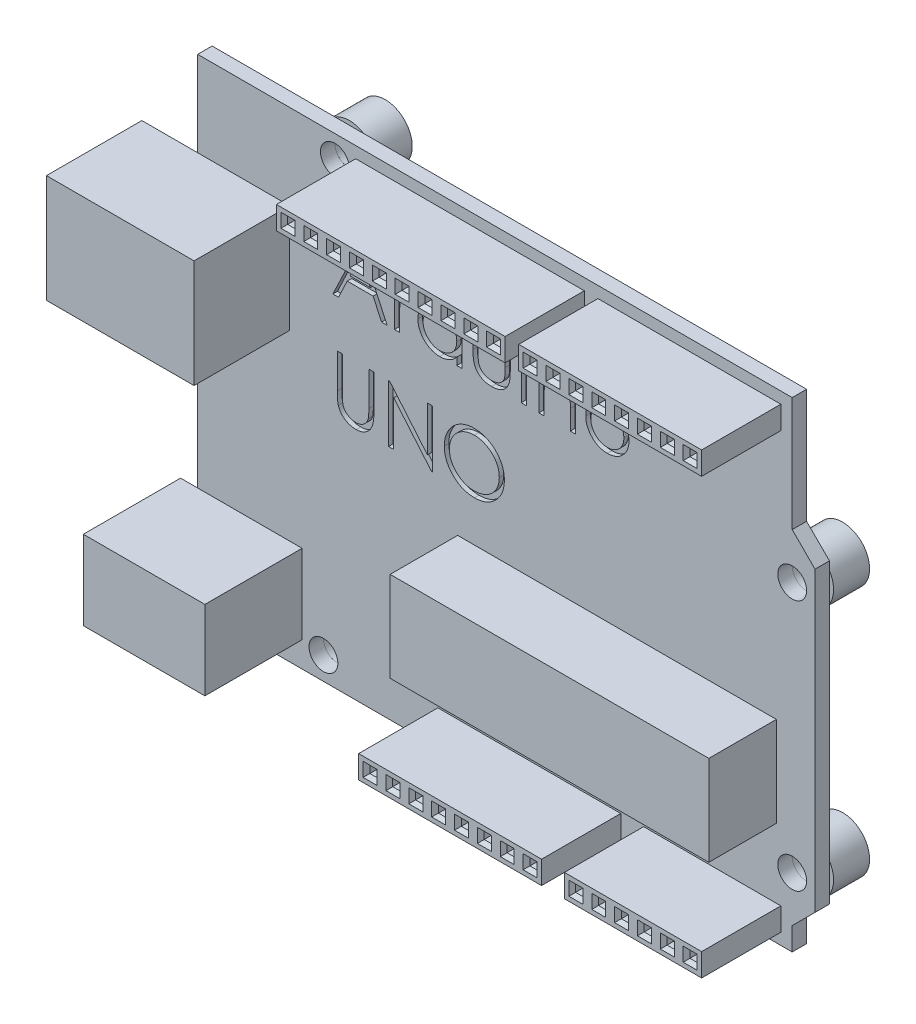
from build123d import *

# Parameters (mm, degrees)
ESQUISSE2_R             = 1.6
BOSS_EXTRU_1_DEPTH      = 1.6
ESQUISSE3_W             = 47.23
ESQUISSE3_H             = 2.54
ESQUISSE3_W_2           = 0.8
ESQUISSE3_H_2           = 0.8
ESQUISSE3_W_3           = 38.1
BOSS_EXTRU_2_DEPTH      = 8.8
CHANFREIN2_SIZE         = 0.375
ESQUISSE4_W             = 35.4
ESQUISSE4_H             = 10
BOSS_EXTRU_3_DEPTH      = 7.5
ESQUISSE5_W             = 16.4
ESQUISSE5_H             = 12
BOSS_EXTRU_4_DEPTH      = 10.6
ESQUISSE6_W             = 13.5
ESQUISSE6_H             = 8.8
BOSS_EXTRU_5_DEPTH      = 10.8
ESQUISSE7_W             = 2.54
ESQUISSE7_H             = 2.54
ESQUISSE7_W_2           = 1.51
ENL_V_MAT_EXTRU_1_DEPTH = 8.8
ESQUISSE8_R             = 3
ESQUISSE8_R_2           = 1.6
BOSS_EXTRU_6_DEPTH      = 4
BOSS_EXTRU_6_2_DEPTH    = 4
BOSS_EXTRU_6_3_DEPTH    = 4
BOSS_EXTRU_6_4_DEPTH    = 4
ESQUISSE9_W             = 0.569871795
ESQUISSE9_H             = 4.640384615
ENL_V_MAT_EXTRU_2_DEPTH = 0.5


with BuildPart() as part:
    # Esquisse2 → Boss.-Extru.1 (new body)
    with BuildSketch(Plane.XY):
        Polygon((0, 0), (66.04, 0), (66.04, 2.54), (68.58, 5.08), (68.58, 38.1), (66.04, 40.64), (66.04, 53.34), (0, 53.34), align=None)
        with Locations((15.24, 50.8)):
            Circle(ESQUISSE2_R, mode=Mode.SUBTRACT)
        with Locations((13.97, 2.54)):
            Circle(ESQUISSE2_R, mode=Mode.SUBTRACT)
        with Locations((66.04, 7.62)):
            Circle(ESQUISSE2_R, mode=Mode.SUBTRACT)
        with Locations((66.04, 35.56)):
            Circle(ESQUISSE2_R, mode=Mode.SUBTRACT)
    extrude(amount=BOSS_EXTRU_1_DEPTH)

    # Esquisse3 → Boss.-Extru.2 (add)
    # profile 1 of 2: a face of its own
    with BuildSketch(Plane.XY.offset(1.6)):
        with Locations((41.165, 50.8)):
            Rectangle(ESQUISSE3_W, ESQUISSE3_H)
        with Locations((63.51, 50.8)):
            Rectangle(ESQUISSE3_W_2, ESQUISSE3_H_2, mode=Mode.SUBTRACT)
        with Locations((60.97, 50.8)):
            Rectangle(ESQUISSE3_W_2, ESQUISSE3_H_2, mode=Mode.SUBTRACT)
        with Locations((58.43, 50.8)):
            Rectangle(ESQUISSE3_W_2, ESQUISSE3_H_2, mode=Mode.SUBTRACT)
        with Locations((55.89, 50.8)):
            Rectangle(ESQUISSE3_W_2, ESQUISSE3_H_2, mode=Mode.SUBTRACT)
        with Locations((53.35, 50.8)):
            Rectangle(ESQUISSE3_W_2, ESQUISSE3_H_2, mode=Mode.SUBTRACT)
        with Locations((50.81, 50.8)):
            Rectangle(ESQUISSE3_W_2, ESQUISSE3_H_2, mode=Mode.SUBTRACT)
        with Locations((48.27, 50.8)):
            Rectangle(ESQUISSE3_W_2, ESQUISSE3_H_2, mode=Mode.SUBTRACT)
        with Locations((45.73, 50.8)):
            Rectangle(ESQUISSE3_W_2, ESQUISSE3_H_2, mode=Mode.SUBTRACT)
        with Locations((41.68, 50.8)):
            Rectangle(ESQUISSE3_W_2, ESQUISSE3_H_2, mode=Mode.SUBTRACT)
        with Locations((39.14, 50.8)):
            Rectangle(ESQUISSE3_W_2, ESQUISSE3_H_2, mode=Mode.SUBTRACT)
        with Locations((36.6, 50.8)):
            Rectangle(ESQUISSE3_W_2, ESQUISSE3_H_2, mode=Mode.SUBTRACT)
        with Locations((34.06, 50.8)):
            Rectangle(ESQUISSE3_W_2, ESQUISSE3_H_2, mode=Mode.SUBTRACT)
        with Locations((31.52, 50.8)):
            Rectangle(ESQUISSE3_W_2, ESQUISSE3_H_2, mode=Mode.SUBTRACT)
        with Locations((28.98, 50.8)):
            Rectangle(ESQUISSE3_W_2, ESQUISSE3_H_2, mode=Mode.SUBTRACT)
        with Locations((26.44, 50.8)):
            Rectangle(ESQUISSE3_W_2, ESQUISSE3_H_2, mode=Mode.SUBTRACT)
        with Locations((23.9, 50.8)):
            Rectangle(ESQUISSE3_W_2, ESQUISSE3_H_2, mode=Mode.SUBTRACT)
        with Locations((21.36, 50.8)):
            Rectangle(ESQUISSE3_W_2, ESQUISSE3_H_2, mode=Mode.SUBTRACT)
        with Locations((18.82, 50.8)):
            Rectangle(ESQUISSE3_W_2, ESQUISSE3_H_2, mode=Mode.SUBTRACT)
    # profile 2 of 2: a face of its own
    with BuildSketch(Plane.XY.offset(1.6)):
        with Locations((45.73, 2.54)):
            Rectangle(ESQUISSE3_W_3, ESQUISSE3_H)
        with Locations((30.49, 2.54)):
            Rectangle(ESQUISSE3_W_2, ESQUISSE3_H_2, mode=Mode.SUBTRACT)
        with Locations((27.95, 2.54)):
            Rectangle(ESQUISSE3_W_2, ESQUISSE3_H_2, mode=Mode.SUBTRACT)
        with Locations((33.03, 2.54)):
            Rectangle(ESQUISSE3_W_2, ESQUISSE3_H_2, mode=Mode.SUBTRACT)
        with Locations((35.57, 2.54)):
            Rectangle(ESQUISSE3_W_2, ESQUISSE3_H_2, mode=Mode.SUBTRACT)
        with Locations((38.11, 2.54)):
            Rectangle(ESQUISSE3_W_2, ESQUISSE3_H_2, mode=Mode.SUBTRACT)
        with Locations((40.65, 2.54)):
            Rectangle(ESQUISSE3_W_2, ESQUISSE3_H_2, mode=Mode.SUBTRACT)
        with Locations((43.19, 2.54)):
            Rectangle(ESQUISSE3_W_2, ESQUISSE3_H_2, mode=Mode.SUBTRACT)
        with Locations((45.73, 2.54)):
            Rectangle(ESQUISSE3_W_2, ESQUISSE3_H_2, mode=Mode.SUBTRACT)
        with Locations((50.81, 2.54)):
            Rectangle(ESQUISSE3_W_2, ESQUISSE3_H_2, mode=Mode.SUBTRACT)
        with Locations((53.35, 2.54)):
            Rectangle(ESQUISSE3_W_2, ESQUISSE3_H_2, mode=Mode.SUBTRACT)
        with Locations((55.89, 2.54)):
            Rectangle(ESQUISSE3_W_2, ESQUISSE3_H_2, mode=Mode.SUBTRACT)
        with Locations((58.43, 2.54)):
            Rectangle(ESQUISSE3_W_2, ESQUISSE3_H_2, mode=Mode.SUBTRACT)
        with Locations((60.97, 2.54)):
            Rectangle(ESQUISSE3_W_2, ESQUISSE3_H_2, mode=Mode.SUBTRACT)
        with Locations((63.51, 2.54)):
            Rectangle(ESQUISSE3_W_2, ESQUISSE3_H_2, mode=Mode.SUBTRACT)
    extrude(amount=BOSS_EXTRU_2_DEPTH)

    # Chanfrein2
    chanfrein2_edges = [part.edges().sort_by_distance(p)[0] for p in [
        (63.91, 50.8, 10.4),
        (63.51, 51.2, 10.4),
        (63.11, 50.8, 10.4),
        (63.51, 50.4, 10.4),
        (39.54, 50.8, 10.4),
        (39.14, 51.2, 10.4),
        (38.74, 50.8, 10.4),
        (39.14, 50.4, 10.4),
        (61.37, 50.8, 10.4),
        (60.97, 51.2, 10.4),
        (60.57, 50.8, 10.4),
        (60.97, 50.4, 10.4),
        (58.83, 50.8, 10.4),
        (58.43, 51.2, 10.4),
        (58.03, 50.8, 10.4),
        (58.43, 50.4, 10.4),
        (56.29, 50.8, 10.4),
        (55.89, 51.2, 10.4),
        (55.49, 50.8, 10.4),
        (55.89, 50.4, 10.4),
        (53.75, 50.8, 10.4),
        (53.35, 51.2, 10.4),
        (52.95, 50.8, 10.4),
        (53.35, 50.4, 10.4),
        (51.21, 50.8, 10.4),
        (50.81, 51.2, 10.4),
        (50.41, 50.8, 10.4),
        (50.81, 50.4, 10.4),
        (48.67, 50.8, 10.4),
        (48.27, 51.2, 10.4),
        (47.87, 50.8, 10.4),
        (48.27, 50.4, 10.4),
        (46.13, 50.8, 10.4),
        (45.73, 51.2, 10.4),
        (45.33, 50.8, 10.4),
        (45.73, 50.4, 10.4),
        (42.08, 50.8, 10.4),
        (41.68, 51.2, 10.4),
        (41.28, 50.8, 10.4),
        (41.68, 50.4, 10.4),
        (37, 50.8, 10.4),
        (36.6, 51.2, 10.4),
        (36.2, 50.8, 10.4),
        (36.6, 50.4, 10.4),
        (34.46, 50.8, 10.4),
        (34.06, 51.2, 10.4),
        (33.66, 50.8, 10.4),
        (34.06, 50.4, 10.4),
        (31.92, 50.8, 10.4),
        (31.52, 51.2, 10.4),
        (31.12, 50.8, 10.4),
        (31.52, 50.4, 10.4),
        (29.38, 50.8, 10.4),
        (28.98, 51.2, 10.4),
        (28.58, 50.8, 10.4),
        (28.98, 50.4, 10.4),
        (26.84, 50.8, 10.4),
        (26.44, 51.2, 10.4),
        (26.04, 50.8, 10.4),
        (26.44, 50.4, 10.4),
        (24.3, 50.8, 10.4),
        (23.9, 51.2, 10.4),
        (23.5, 50.8, 10.4),
        (23.9, 50.4, 10.4),
        (21.76, 50.8, 10.4),
        (21.36, 51.2, 10.4),
        (20.96, 50.8, 10.4),
        (21.36, 50.4, 10.4),
        (19.22, 50.8, 10.4),
        (18.82, 51.2, 10.4),
        (18.42, 50.8, 10.4),
        (18.82, 50.4, 10.4),
        (28.35, 2.54, 10.4),
        (27.95, 2.94, 10.4),
        (27.55, 2.54, 10.4),
        (27.95, 2.14, 10.4),
        (30.89, 2.54, 10.4),
        (30.49, 2.94, 10.4),
        (30.09, 2.54, 10.4),
        (30.49, 2.14, 10.4),
        (33.43, 2.54, 10.4),
        (33.03, 2.94, 10.4),
        (32.63, 2.54, 10.4),
        (33.03, 2.14, 10.4),
        (35.97, 2.54, 10.4),
        (35.57, 2.94, 10.4),
        (35.17, 2.54, 10.4),
        (35.57, 2.14, 10.4),
        (38.51, 2.54, 10.4),
        (38.11, 2.94, 10.4),
        (37.71, 2.54, 10.4),
        (38.11, 2.14, 10.4),
        (41.05, 2.54, 10.4),
        (40.65, 2.94, 10.4),
        (40.25, 2.54, 10.4),
        (40.65, 2.14, 10.4),
        (43.59, 2.54, 10.4),
        (43.19, 2.94, 10.4),
        (42.79, 2.54, 10.4),
        (43.19, 2.14, 10.4),
        (46.13, 2.54, 10.4),
        (45.73, 2.94, 10.4),
        (45.33, 2.54, 10.4),
        (45.73, 2.14, 10.4),
        (51.21, 2.54, 10.4),
        (50.81, 2.94, 10.4),
        (50.41, 2.54, 10.4),
        (50.81, 2.14, 10.4),
        (53.75, 2.54, 10.4),
        (53.35, 2.94, 10.4),
        (52.95, 2.54, 10.4),
        (53.35, 2.14, 10.4),
        (56.29, 2.54, 10.4),
        (55.89, 2.94, 10.4),
        (55.49, 2.54, 10.4),
        (55.89, 2.14, 10.4),
        (58.83, 2.54, 10.4),
        (58.43, 2.94, 10.4),
        (58.03, 2.54, 10.4),
        (58.43, 2.14, 10.4),
        (61.37, 2.54, 10.4),
        (60.97, 2.94, 10.4),
        (60.57, 2.54, 10.4),
        (60.97, 2.14, 10.4),
        (63.91, 2.54, 10.4),
        (63.51, 2.94, 10.4),
        (63.11, 2.54, 10.4),
        (63.51, 2.14, 10.4),
    ]]
    chamfer(chanfrein2_edges, length=CHANFREIN2_SIZE)

    # Esquisse4 → Boss.-Extru.3 (add)
    with BuildSketch(Plane.XY.offset(1.6)):
        with Locations((46.58, 16.5)):
            Rectangle(ESQUISSE4_W, ESQUISSE4_H)
    extrude(amount=BOSS_EXTRU_3_DEPTH)

    # Esquisse5 → Boss.-Extru.4 (add)
    with BuildSketch(Plane.XY.offset(1.6)):
        with Locations((2, 37.87)):
            Rectangle(ESQUISSE5_W, ESQUISSE5_H)
    extrude(amount=BOSS_EXTRU_4_DEPTH)

    # Esquisse7 → Enl_v. mat.-Extru.1 (cut)
    with BuildSketch(Plane.XY.offset(10.4)):
        with Locations((48.27, 2.54)):
            Rectangle(ESQUISSE7_W, ESQUISSE7_H)
        with Locations((43.705, 50.8)):
            Rectangle(ESQUISSE7_W_2, ESQUISSE7_H)
    extrude(amount=-ENL_V_MAT_EXTRU_1_DEPTH, mode=Mode.SUBTRACT)

    # Esquisse9 → Enl_v. mat.-Extru.2 (cut)
    # profile 1 of 11: a face of its own
    with BuildSketch(Plane.XY.offset(1.6)):
        Polygon((18.114842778, 44.142918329), (21.045612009, 37.792918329), (20.426130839, 37.792918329), (19.48736882, 39.828174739), (16.608753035, 39.828174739), (15.643278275, 37.792918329), (15.021253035, 37.792918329), (18.033432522, 44.142918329), align=None)
        Polygon((18.067777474, 42.905228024), (16.917857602, 40.47945679), (19.1871685, 40.47945679), align=None, mode=Mode.SUBTRACT)
    # profile 2 of 11: a face of its own
    with BuildSketch(Plane.XY.offset(1.6)):
        with BuildLine():
            Line((21.859714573, 42.433302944), (22.429586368, 42.433302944))
            Line((22.429586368, 42.433302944), (22.429586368, 41.750220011))
            add(Edge.make_bspline(
                [(22.429586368, 41.750220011), (22.471657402, 41.8138213), (22.552117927, 41.93545827), (22.685854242, 42.096329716), (22.822838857, 42.229525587), (22.963727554, 42.335667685), (23.109556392, 42.4151572), (23.257124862, 42.473383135), (23.408754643, 42.507813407), (23.51064842, 42.512410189), (23.561697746, 42.514713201)],
                knots=[0, 0, 0, 0, 1.2804753, 2.448899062, 3.506932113, 4.484331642, 5.4025378, 6.288909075, 7.142734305, 8, 8, 8, 8], degree=3))
            add(Edge.make_bspline(
                [(23.561697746, 42.514713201), (23.601296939, 42.512553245), (23.68277485, 42.508108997), (23.806114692, 42.476883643), (23.933193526, 42.42703066), (24.015094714, 42.380149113), (24.057791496, 42.355708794)],
                knots=[0, 0, 0, 0, 0.901110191, 1.854092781, 2.881294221, 4, 4, 4, 4], degree=3))
            Line((24.057791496, 42.355708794), (23.744870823, 41.862159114))
            add(Edge.make_bspline(
                [(23.744870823, 41.862159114), (23.717458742, 41.874387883), (23.665425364, 41.897600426), (23.589307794, 41.925072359), (23.519128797, 41.941248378), (23.474418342, 41.943698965), (23.45357475, 41.944841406)],
                knots=[0, 0, 0, 0, 1.180555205, 2.24091978, 3.179933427, 4, 4, 4, 4], degree=3))
            add(Edge.make_bspline(
                [(23.45357475, 41.944841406), (23.407844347, 41.941793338), (23.314567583, 41.935576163), (23.177617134, 41.886701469), (23.044725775, 41.807734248), (22.939185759, 41.720156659), (22.857466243, 41.635705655), (22.799154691, 41.561957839), (22.745664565, 41.479265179), (22.694555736, 41.389041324), (22.647989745, 41.289745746), (22.604529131, 41.182370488), (22.565233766, 41.066791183), (22.542826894, 40.98626861), (22.531349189, 40.945021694)],
                knots=[0, 0, 0, 0, 1.125678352, 2.296057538, 3.5422874, 4.923748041, 5.663163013, 6.437101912, 7.23742474, 8.08941207, 8.991984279, 9.93940061, 10.944477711, 12, 12, 12, 12], degree=3))
            add(Edge.make_bspline(
                [(22.531349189, 40.945021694), (22.522763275, 40.908233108), (22.503746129, 40.826749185), (22.485255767, 40.690045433), (22.466986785, 40.52853108), (22.454111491, 40.341756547), (22.442177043, 40.130188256), (22.435445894, 39.893503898), (22.429815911, 39.631460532), (22.429665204, 39.448264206), (22.429586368, 39.352433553)],
                knots=[0, 0, 0, 0, 0.566838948, 1.255505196, 2.06880316, 3.007127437, 4.065329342, 5.249902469, 6.561414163, 8, 8, 8, 8], degree=3))
            Line((22.429586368, 39.352433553), (22.429586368, 37.792918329))
            Line((22.429586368, 37.792918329), (21.859714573, 37.792918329))
            Line((21.859714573, 37.792918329), (21.859714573, 42.433302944))
        make_face()
    # profile 3 of 11: a face of its own
    with BuildSketch(Plane.XY.offset(1.6)):
        with BuildLine():
            Line((29.349458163, 44.305738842), (29.349458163, 37.792918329))
            Line((29.349458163, 37.792918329), (28.779586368, 37.792918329))
            Line((28.779586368, 37.792918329), (28.779586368, 38.595572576))
            add(Edge.make_bspline(
                [(28.779586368, 38.595572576), (28.715326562, 38.522929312), (28.589922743, 38.38116507), (28.380479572, 38.195958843), (28.158468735, 38.04287246), (27.924967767, 37.919229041), (27.680187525, 37.826352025), (27.424670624, 37.760337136), (27.158312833, 37.717894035), (26.976426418, 37.713655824), (26.884253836, 37.711508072)],
                knots=[0, 0, 0, 0, 1.074387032, 2.096679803, 3.090159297, 4.057316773, 5.018401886, 5.985159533, 6.978961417, 8, 8, 8, 8], degree=3))
            add(Edge.make_bspline(
                [(26.884253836, 37.711508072), (26.802306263, 37.713733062), (26.64070202, 37.71812084), (26.402977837, 37.75216102), (26.17421047, 37.806826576), (25.954183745, 37.882846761), (25.744321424, 37.983686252), (25.542826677, 38.104411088), (25.350743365, 38.248176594), (25.170999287, 38.412529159), (25.005478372, 38.591045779), (24.860224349, 38.781446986), (24.73911519, 38.982909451), (24.637841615, 39.192882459), (24.559833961, 39.412982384), (24.505453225, 39.642448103), (24.4714527, 39.881008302), (24.467066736, 40.04345858), (24.464842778, 40.125830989)],
                knots=[0, 0, 0, 0, 1.033919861, 2.038935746, 3.024066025, 3.998881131, 4.97069526, 5.957263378, 6.95902576, 7.993208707, 9.027059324, 10.027763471, 11.009749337, 11.988697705, 12.965288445, 13.950418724, 14.960734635, 16, 16, 16, 16], degree=3))
            add(Edge.make_bspline(
                [(24.464842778, 40.125830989), (24.467116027, 40.206500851), (24.471610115, 40.365980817), (24.505089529, 40.600529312), (24.561388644, 40.826441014), (24.640396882, 41.04298861), (24.741710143, 41.25043413), (24.864951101, 41.44892429), (25.010128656, 41.639005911), (25.17750088, 41.816209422), (25.358811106, 41.979895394), (25.552774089, 42.122151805), (25.7545649, 42.245009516), (25.967313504, 42.342352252), (26.187870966, 42.42110877), (26.418200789, 42.475597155), (26.657344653, 42.507705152), (26.819705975, 42.512354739), (26.90206233, 42.514713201)],
                knots=[0, 0, 0, 0, 1.020392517, 2.01726096, 2.990465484, 3.961182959, 4.928053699, 5.906110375, 6.912531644, 7.948652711, 8.985773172, 9.998621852, 10.987621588, 11.969261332, 12.953316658, 13.946091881, 14.958173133, 16, 16, 16, 16], degree=3))
            add(Edge.make_bspline(
                [(26.90206233, 42.514713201), (26.996798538, 42.511870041), (27.182755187, 42.506289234), (27.454713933, 42.459650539), (27.711957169, 42.381340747), (27.955965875, 42.274132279), (28.185285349, 42.134793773), (28.401596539, 41.966516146), (28.601137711, 41.764536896), (28.719196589, 41.612841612), (28.779586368, 41.535246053)],
                knots=[0, 0, 0, 0, 1.031072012, 2.023879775, 2.993683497, 3.952812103, 4.918022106, 5.908088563, 6.929940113, 8, 8, 8, 8], degree=3))
            Line((28.779586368, 41.535246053), (28.779586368, 44.305738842))
            Line((28.779586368, 44.305738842), (29.349458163, 44.305738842))
        make_face()
        with BuildLine():
            add(Edge.make_bspline(
                [(26.909694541, 41.944841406), (26.826392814, 41.94187752), (26.661968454, 41.936027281), (26.420588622, 41.890355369), (26.189605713, 41.814364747), (25.970174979, 41.710439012), (25.765762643, 41.579758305), (25.583075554, 41.421695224), (25.42061951, 41.240562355), (25.283988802, 41.037177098), (25.172608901, 40.819139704), (25.094291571, 40.59122108), (25.042640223, 40.35753205), (25.037363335, 40.199031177), (25.034714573, 40.119470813)],
                knots=[0, 0, 0, 0, 1.031046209, 2.035121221, 3.029706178, 4.034933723, 5.034054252, 6.02443088, 7.017295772, 8.038157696, 9.050218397, 10.03989886, 11.016116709, 12, 12, 12, 12], degree=3))
            add(Edge.make_bspline(
                [(25.034714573, 40.119470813), (25.038098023, 40.040385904), (25.044851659, 39.882526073), (25.093385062, 39.648518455), (25.174809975, 39.420546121), (25.285920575, 39.200544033), (25.425052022, 38.996284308), (25.586321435, 38.811698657), (25.771288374, 38.652967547), (25.976171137, 38.520093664), (26.194988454, 38.412755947), (26.425101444, 38.338069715), (26.662184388, 38.289850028), (26.823387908, 38.28421762), (26.9046064, 38.281379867)],
                knots=[0, 0, 0, 0, 0.979072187, 1.954306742, 2.945804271, 3.96968567, 4.997920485, 5.998718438, 6.996577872, 8.005894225, 9.015743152, 10.005417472, 10.995077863, 12, 12, 12, 12], degree=3))
            add(Edge.make_bspline(
                [(26.9046064, 38.281379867), (26.987059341, 38.284391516), (27.151050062, 38.290381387), (27.393146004, 38.336248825), (27.628086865, 38.41202936), (27.852672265, 38.517074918), (28.061888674, 38.647263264), (28.249663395, 38.799676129), (28.408442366, 38.97693762), (28.543048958, 39.171749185), (28.648595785, 39.385312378), (28.725478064, 39.61270441), (28.770933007, 39.853933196), (28.776662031, 40.018786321), (28.779586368, 40.102934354)],
                knots=[0, 0, 0, 0, 1.01762866, 2.023962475, 3.030623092, 4.058876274, 5.077231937, 6.066672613, 7.034107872, 8.005628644, 8.981990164, 9.965428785, 10.961468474, 12, 12, 12, 12], degree=3))
            add(Edge.make_bspline(
                [(28.779586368, 40.102934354), (28.777845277, 40.167047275), (28.77441826, 40.293241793), (28.748237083, 40.478530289), (28.706590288, 40.655847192), (28.647905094, 40.825378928), (28.570813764, 40.98618817), (28.477835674, 41.139429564), (28.367335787, 41.284306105), (28.241092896, 41.418822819), (28.102907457, 41.541516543), (27.956685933, 41.651034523), (27.800695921, 41.741002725), (27.637560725, 41.815463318), (27.466997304, 41.874716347), (27.287617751, 41.914245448), (27.101328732, 41.941387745), (26.974245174, 41.943678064), (26.909694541, 41.944841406)],
                knots=[0, 0, 0, 0, 1.050140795, 2.067009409, 3.05949893, 4.030605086, 5.00011959, 5.97591094, 6.962425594, 7.979863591, 8.993523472, 9.986985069, 10.967611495, 11.937549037, 12.921786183, 13.919465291, 14.943216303, 16, 16, 16, 16], degree=3))
        make_face(mode=Mode.SUBTRACT)
    # profile 4 of 11: a face of its own
    with BuildSketch(Plane.XY.offset(1.6)):
        with BuildLine():
            Line((30.570612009, 42.433302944), (31.140483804, 42.433302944))
            Line((31.140483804, 42.433302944), (31.140483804, 40.28101929))
            add(Edge.make_bspline(
                [(31.140483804, 40.28101929), (31.14074126, 40.217840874), (31.141233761, 40.096983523), (31.144573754, 39.923074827), (31.152429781, 39.764475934), (31.162252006, 39.621095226), (31.17488331, 39.492956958), (31.189911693, 39.380508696), (31.206709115, 39.282475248), (31.223151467, 39.223432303), (31.230798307, 39.195973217)],
                knots=[0, 0, 0, 0, 1.388932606, 2.656963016, 3.823490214, 4.879454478, 5.816252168, 6.653371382, 7.373723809, 8, 8, 8, 8], degree=3))
            add(Edge.make_bspline(
                [(31.230798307, 39.195973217), (31.243065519, 39.161460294), (31.267344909, 39.093151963), (31.311383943, 38.994474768), (31.365863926, 38.903079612), (31.425481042, 38.815442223), (31.494241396, 38.734158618), (31.571275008, 38.659366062), (31.654003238, 38.588238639), (31.776930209, 38.504083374), (31.945040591, 38.413885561), (32.165753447, 38.33606029), (32.4050654, 38.289549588), (32.570464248, 38.28415344), (32.655477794, 38.281379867)],
                knots=[0, 0, 0, 0, 0.725840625, 1.436591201, 2.137033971, 2.831655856, 3.53531722, 4.242432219, 4.957935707, 5.694543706, 7.190802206, 8.724350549, 10.316345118, 12, 12, 12, 12], degree=3))
            add(Edge.make_bspline(
                [(32.655477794, 38.281379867), (32.740483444, 38.284212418), (32.904953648, 38.28969288), (33.141636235, 38.3346573), (33.357992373, 38.409779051), (33.551850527, 38.514658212), (33.722331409, 38.643004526), (33.864397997, 38.793606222), (33.981614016, 38.961698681), (34.032793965, 39.087109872), (34.058532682, 39.150179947)],
                knots=[0, 0, 0, 0, 1.157059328, 2.238695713, 3.266970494, 4.264342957, 5.228770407, 6.160125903, 7.074715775, 8, 8, 8, 8], degree=3))
            add(Edge.make_bspline(
                [(34.058532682, 39.150179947), (34.066142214, 39.175518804), (34.08296503, 39.231536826), (34.101039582, 39.326568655), (34.11732182, 39.439897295), (34.131225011, 39.572264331), (34.141140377, 39.72332385), (34.146485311, 39.893028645), (34.152523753, 40.08084597), (34.152615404, 40.212323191), (34.152663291, 40.28101929)],
                knots=[0, 0, 0, 0, 0.557542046, 1.232589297, 2.036731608, 2.971723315, 4.038036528, 5.22795436, 6.551621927, 8, 8, 8, 8], degree=3))
            Line((34.152663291, 40.28101929), (34.152663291, 42.433302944))
            Line((34.152663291, 42.433302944), (34.722535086, 42.433302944))
            Line((34.722535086, 42.433302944), (34.722535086, 40.174168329))
            add(Edge.make_bspline(
                [(34.722535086, 40.174168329), (34.721733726, 40.097411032), (34.720178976, 39.948491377), (34.710187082, 39.732075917), (34.693042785, 39.530395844), (34.667021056, 39.343344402), (34.636421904, 39.1710644), (34.596949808, 39.013335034), (34.549817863, 38.870642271), (34.496649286, 38.74048219), (34.433835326, 38.62246854), (34.367020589, 38.510462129), (34.289868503, 38.40724209), (34.208642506, 38.307670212), (34.118288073, 38.216699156), (34.020498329, 38.132241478), (33.916649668, 38.05300612), (33.804437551, 37.982083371), (33.685500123, 37.918190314), (33.559690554, 37.861555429), (33.425467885, 37.816737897), (33.284563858, 37.77807426), (33.13628813, 37.747749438), (32.980783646, 37.726365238), (32.818102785, 37.713256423), (32.707232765, 37.712100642), (32.650389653, 37.711508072)],
                knots=[0, 0, 0, 0, 1.493040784, 2.896703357, 4.213163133, 5.428574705, 6.569057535, 7.615249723, 8.588095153, 9.490268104, 10.346124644, 11.18633936, 12.024365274, 12.850166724, 13.684164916, 14.514361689, 15.362232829, 16.222528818, 17.093394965, 17.986930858, 18.902426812, 19.842810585, 20.827885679, 21.843828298, 22.894529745, 24, 24, 24, 24], degree=3))
            add(Edge.make_bspline(
                [(32.650389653, 37.711508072), (32.593971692, 37.712124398), (32.483105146, 37.713335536), (32.320415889, 37.726292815), (32.16448056, 37.747716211), (32.015853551, 37.778296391), (31.874385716, 37.816467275), (31.739504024, 37.861830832), (31.612787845, 37.918219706), (31.492714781, 37.981678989), (31.380224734, 38.053461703), (31.274799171, 38.132143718), (31.176579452, 38.217607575), (31.085543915, 38.309496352), (31.002970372, 38.408949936), (30.927829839, 38.51516831), (30.858965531, 38.627099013), (30.796639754, 38.746956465), (30.743096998, 38.878622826), (30.695825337, 39.024304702), (30.65716175, 39.185599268), (30.625697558, 39.362368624), (30.600385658, 39.553766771), (30.582812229, 39.760900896), (30.572986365, 39.983266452), (30.571420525, 40.136845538), (30.570612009, 40.216145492)],
                knots=[0, 0, 0, 0, 1.083640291, 2.129454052, 3.13281866, 4.105697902, 5.042300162, 5.946461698, 6.836384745, 7.703652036, 8.553297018, 9.397182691, 10.228592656, 11.052265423, 11.879314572, 12.708807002, 13.549817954, 14.402308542, 15.300838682, 16.27712199, 17.341985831, 18.484375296, 19.725102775, 21.0496083, 22.476576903, 24, 24, 24, 24], degree=3))
            Line((30.570612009, 40.216145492), (30.570612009, 42.433302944))
        make_face()
    # profile 5 of 11: a face of its own
    with BuildSketch(Plane.XY.offset(1.6)):
        with BuildLine():
            add(Edge.make_bspline(
                [(36.226080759, 44.387149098), (36.261443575, 44.385508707), (36.33069076, 44.382296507), (36.430827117, 44.354789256), (36.522007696, 44.308162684), (36.60288444, 44.245606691), (36.672284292, 44.172038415), (36.720872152, 44.086293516), (36.752100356, 43.993658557), (36.75587145, 43.929042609), (36.757791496, 43.896143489)],
                knots=[0, 0, 0, 0, 1.055194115, 2.066272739, 3.074728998, 4.095836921, 5.109056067, 6.073838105, 7.019297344, 8, 8, 8, 8], degree=3))
            add(Edge.make_bspline(
                [(36.757791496, 43.896143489), (36.755828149, 43.86409839), (36.751946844, 43.800749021), (36.720896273, 43.709720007), (36.671870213, 43.625166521), (36.602928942, 43.55174109), (36.521995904, 43.48921968), (36.43083025, 43.442583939), (36.330689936, 43.415079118), (36.261443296, 43.411866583), (36.226080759, 43.410226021)],
                knots=[0, 0, 0, 0, 0.96129708, 1.900370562, 2.859976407, 3.87933698, 4.906634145, 5.921202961, 6.938410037, 8, 8, 8, 8], degree=3))
            add(Edge.make_bspline(
                [(36.226080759, 43.410226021), (36.191122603, 43.411803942), (36.123081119, 43.414875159), (36.024444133, 43.44312362), (35.934041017, 43.489235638), (35.853006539, 43.551331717), (35.785460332, 43.625617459), (35.736296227, 43.709668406), (35.705317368, 43.800762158), (35.701426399, 43.864102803), (35.699458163, 43.896143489)],
                knots=[0, 0, 0, 0, 1.054934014, 2.053291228, 3.073705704, 4.106921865, 5.123545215, 6.088680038, 7.033164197, 8, 8, 8, 8], degree=3))
            add(Edge.make_bspline(
                [(35.699458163, 43.896143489), (35.701383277, 43.92903803), (35.705164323, 43.993644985), (35.736319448, 44.086345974), (35.785050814, 44.171583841), (35.853051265, 44.246015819), (35.934029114, 44.308146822), (36.024447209, 44.354249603), (36.123080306, 44.382500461), (36.191122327, 44.385571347), (36.226080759, 44.387149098)],
                knots=[0, 0, 0, 0, 0.98631895, 1.937192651, 2.907499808, 3.917963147, 4.944918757, 5.95915025, 6.951458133, 8, 8, 8, 8], degree=3))
        make_face()
    # profile 6 of 11: a face of its own
    with BuildSketch(Plane.XY.offset(1.6)):
        with Locations((36.22862483, 40.113110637)):
            Rectangle(ESQUISSE9_W, ESQUISSE9_H)
    # profile 7 of 11: a face of its own
    with BuildSketch(Plane.XY.offset(1.6)):
        with BuildLine():
            Line((37.897535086, 42.433302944), (38.467406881, 42.433302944))
            Line((38.467406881, 42.433302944), (38.467406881, 41.596303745))
            add(Edge.make_bspline(
                [(38.467406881, 41.596303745), (38.528253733, 41.6722184), (38.646329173, 41.819533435), (38.842969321, 42.013155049), (39.050784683, 42.172712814), (39.268502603, 42.299901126), (39.496418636, 42.395780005), (39.733143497, 42.465023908), (39.980094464, 42.506543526), (40.148032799, 42.511968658), (40.232991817, 42.514713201)],
                knots=[0, 0, 0, 0, 1.12780773, 2.188550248, 3.19190651, 4.159438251, 5.104880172, 6.052711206, 7.014878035, 8, 8, 8, 8], degree=3))
            add(Edge.make_bspline(
                [(40.232991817, 42.514713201), (40.31886311, 42.511546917), (40.486933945, 42.505349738), (40.731641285, 42.456333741), (40.960193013, 42.372613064), (41.171774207, 42.257928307), (41.362505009, 42.115313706), (41.530008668, 41.949165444), (41.668553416, 41.758055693), (41.761440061, 41.580757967), (41.822628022, 41.423479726), (41.861149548, 41.288774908), (41.8938629, 41.138700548), (41.922223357, 40.973710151), (41.94141326, 40.79264772), (41.956548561, 40.596255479), (41.96739562, 40.384597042), (41.967825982, 40.238208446), (41.968047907, 40.162720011)],
                knots=[0, 0, 0, 0, 1.235846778, 2.418850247, 3.575807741, 4.728682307, 5.871620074, 6.994088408, 8.11269785, 9.256955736, 9.865816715, 10.540099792, 11.271859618, 12.076849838, 12.949306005, 13.892391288, 14.913166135, 16, 16, 16, 16], degree=3))
            Line((41.968047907, 40.162720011), (41.968047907, 37.792918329))
            Line((41.968047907, 37.792918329), (41.398176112, 37.792918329))
            Line((41.398176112, 37.792918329), (41.398176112, 39.975730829))
            add(Edge.make_bspline(
                [(41.398176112, 39.975730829), (41.397825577, 40.038908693), (41.397155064, 40.159757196), (41.395040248, 40.332783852), (41.389942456, 40.489695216), (41.382779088, 40.630116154), (41.372294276, 40.753911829), (41.361367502, 40.861334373), (41.34800533, 40.9522474), (41.33609833, 41.006975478), (41.330758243, 41.031520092)],
                knots=[0, 0, 0, 0, 1.430800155, 2.736877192, 3.918605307, 4.986035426, 5.920637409, 6.731861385, 7.431261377, 8, 8, 8, 8], degree=3))
            add(Edge.make_bspline(
                [(41.330758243, 41.031520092), (41.311480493, 41.103567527), (41.274376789, 41.24223655), (41.182693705, 41.430331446), (41.066916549, 41.590348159), (40.925587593, 41.721297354), (40.760071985, 41.8232073), (40.570829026, 41.893917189), (40.35968492, 41.938142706), (40.211177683, 41.942546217), (40.133773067, 41.944841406)],
                knots=[0, 0, 0, 0, 1.084156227, 2.086665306, 3.027808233, 3.945421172, 4.874247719, 5.839848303, 6.874090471, 8, 8, 8, 8], degree=3))
            add(Edge.make_bspline(
                [(40.133773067, 41.944841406), (40.08793027, 41.943977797), (39.997208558, 41.942268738), (39.862679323, 41.925121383), (39.732188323, 41.897075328), (39.604425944, 41.859213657), (39.481947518, 41.807212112), (39.360818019, 41.74819454), (39.245598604, 41.674628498), (39.13383244, 41.592639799), (39.029850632, 41.501781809), (38.93309779, 41.405906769), (38.846850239, 41.303806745), (38.768711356, 41.197126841), (38.701259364, 41.084401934), (38.64238019, 40.96671955), (38.592422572, 40.843924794), (38.567598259, 40.758698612), (38.555177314, 40.716055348)],
                knots=[0, 0, 0, 0, 1.023777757, 2.026029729, 3.023749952, 4.003683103, 4.997618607, 5.993177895, 7.010360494, 8.046726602, 9.087585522, 10.09234134, 11.086953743, 12.070360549, 13.043493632, 14.017870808, 15.008233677, 16, 16, 16, 16], degree=3))
            add(Edge.make_bspline(
                [(38.555177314, 40.716055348), (38.548029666, 40.68474948), (38.53246961, 40.616598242), (38.515663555, 40.504757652), (38.500409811, 40.375380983), (38.487642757, 40.228619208), (38.479831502, 40.063958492), (38.471314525, 39.882102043), (38.4682138, 39.682324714), (38.467683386, 39.5432385), (38.467406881, 39.470732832)],
                knots=[0, 0, 0, 0, 0.615963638, 1.340920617, 2.168419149, 3.115676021, 4.16674242, 5.331190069, 6.6087489, 8, 8, 8, 8], degree=3))
            Line((38.467406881, 39.470732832), (38.467406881, 37.792918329))
            Line((38.467406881, 37.792918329), (37.897535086, 37.792918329))
            Line((37.897535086, 37.792918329), (37.897535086, 42.433302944))
        make_face()
    # profile 8 of 11: a face of its own
    with BuildSketch(Plane.XY.offset(1.6)):
        with BuildLine():
            add(Edge.make_bspline(
                [(45.511938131, 42.514713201), (45.599008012, 42.512859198), (45.769730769, 42.509223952), (46.019753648, 42.470371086), (46.258414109, 42.410958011), (46.4866262, 42.328822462), (46.701467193, 42.218728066), (46.90606645, 42.087356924), (47.099863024, 41.93172279), (47.216019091, 41.811330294), (47.274978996, 41.750220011)],
                knots=[0, 0, 0, 0, 1.054011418, 2.066658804, 3.057071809, 4.030435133, 4.997543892, 5.974964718, 6.972108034, 8, 8, 8, 8], degree=3))
            add(Edge.make_bspline(
                [(47.274978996, 41.750220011), (47.325746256, 41.691774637), (47.426298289, 41.576014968), (47.555231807, 41.388316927), (47.666305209, 41.193934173), (47.755319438, 40.990285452), (47.825505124, 40.779148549), (47.875335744, 40.559797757), (47.904975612, 40.332717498), (47.908972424, 40.178496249), (47.910996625, 40.100390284)],
                knots=[0, 0, 0, 0, 1.025258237, 2.030674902, 3.01204498, 3.988269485, 4.97094183, 5.956517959, 6.965070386, 8, 8, 8, 8], degree=3))
            add(Edge.make_bspline(
                [(47.910996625, 40.100390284), (47.909216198, 40.021831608), (47.905697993, 39.866596), (47.872417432, 39.637960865), (47.82065389, 39.416264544), (47.74657327, 39.2024352), (47.6515807, 38.995819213), (47.535664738, 38.79731903), (47.398011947, 38.606543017), (47.241976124, 38.425111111), (47.069524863, 38.257895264), (46.882442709, 38.112156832), (46.684406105, 37.987294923), (46.472781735, 37.886717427), (46.249502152, 37.807415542), (46.014085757, 37.75171694), (45.766898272, 37.718040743), (45.598120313, 37.71371626), (45.511938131, 37.711508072)],
                knots=[0, 0, 0, 0, 0.998656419, 1.973391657, 2.932242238, 3.890759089, 4.846373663, 5.82037756, 6.809684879, 7.83454468, 8.860553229, 9.859544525, 10.845671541, 11.83227036, 12.833544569, 13.85385346, 14.904124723, 16, 16, 16, 16], degree=3))
            add(Edge.make_bspline(
                [(45.511938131, 37.711508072), (45.425333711, 37.713723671), (45.25571458, 37.718063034), (45.007654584, 37.751586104), (44.771816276, 37.807389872), (44.54824439, 37.886978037), (44.335710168, 37.987298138), (44.136526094, 38.111779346), (43.949291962, 38.257938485), (43.776804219, 38.4250994), (43.620778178, 38.606546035), (43.483122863, 38.797318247), (43.367207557, 38.995819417), (43.272214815, 39.202435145), (43.19813424, 39.416264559), (43.146370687, 39.637960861), (43.113090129, 39.866596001), (43.109571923, 40.021831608), (43.107791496, 40.100390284)],
                knots=[0, 0, 0, 0, 1.099876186, 2.154163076, 3.173186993, 4.173200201, 5.163417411, 6.152872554, 7.150605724, 8.17532212, 9.198891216, 10.186952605, 11.159729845, 12.11414092, 13.071450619, 14.029093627, 15.002601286, 16, 16, 16, 16], degree=3))
            add(Edge.make_bspline(
                [(43.107791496, 40.100390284), (43.109829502, 40.178071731), (43.113864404, 40.331867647), (43.14347447, 40.558521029), (43.193110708, 40.777500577), (43.263380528, 40.987822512), (43.353215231, 41.190578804), (43.462727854, 41.385441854), (43.592976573, 41.572291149), (43.693128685, 41.687901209), (43.743809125, 41.746403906)],
                knots=[0, 0, 0, 0, 1.031353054, 2.041901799, 3.029428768, 4.008703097, 4.981709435, 5.96992636, 6.972712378, 8, 8, 8, 8], degree=3))
            add(Edge.make_bspline(
                [(43.743809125, 41.746403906), (43.80268014, 41.808044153), (43.91846035, 41.929270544), (44.113221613, 42.084450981), (44.317317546, 42.218555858), (44.534532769, 42.326462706), (44.762557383, 42.411441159), (45.002440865, 42.470524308), (45.253312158, 42.509083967), (45.424870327, 42.512818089), (45.511938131, 42.514713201)],
                knots=[0, 0, 0, 0, 1.027980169, 2.021703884, 2.998553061, 3.971491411, 4.943284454, 5.930300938, 6.949603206, 8, 8, 8, 8], degree=3))
        make_face()
        with BuildLine():
            add(Edge.make_bspline(
                [(45.509394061, 41.944841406), (45.447821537, 41.943091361), (45.326265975, 41.939636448), (45.147341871, 41.913358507), (44.975093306, 41.871725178), (44.809193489, 41.812572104), (44.650201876, 41.736192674), (44.497966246, 41.642378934), (44.35203882, 41.532373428), (44.215274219, 41.406348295), (44.089757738, 41.268682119), (43.980033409, 41.122000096), (43.886733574, 40.96868144), (43.809009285, 40.808566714), (43.75112053, 40.640033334), (43.709078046, 40.464989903), (43.682824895, 40.28307979), (43.679402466, 40.159416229), (43.677663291, 40.096574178)],
                knots=[0, 0, 0, 0, 1.021534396, 2.016698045, 2.994645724, 3.958388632, 4.93408049, 5.916473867, 6.921342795, 7.962252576, 8.998418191, 10.008913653, 10.997312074, 11.973003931, 12.956656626, 13.948281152, 14.957379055, 16, 16, 16, 16], degree=3))
            add(Edge.make_bspline(
                [(43.677663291, 40.096574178), (43.680578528, 40.015381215), (43.686364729, 39.854228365), (43.733418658, 39.616899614), (43.812133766, 39.389058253), (43.91842783, 39.172039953), (44.051607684, 38.97124882), (44.208519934, 38.792230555), (44.387480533, 38.637679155), (44.586356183, 38.509443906), (44.801084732, 38.407554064), (45.028335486, 38.335347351), (45.265355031, 38.288408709), (45.427335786, 38.28374332), (45.509394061, 38.281379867)],
                knots=[0, 0, 0, 0, 1.016792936, 2.018143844, 3.017858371, 4.030088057, 5.03801393, 6.028138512, 7.003788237, 7.991172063, 8.984598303, 9.972568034, 10.972917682, 12, 12, 12, 12], degree=3))
            add(Edge.make_bspline(
                [(45.509394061, 38.281379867), (45.591447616, 38.28375709), (45.753419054, 38.288449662), (45.990109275, 38.335110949), (46.21673891, 38.407870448), (46.431244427, 38.509329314), (46.63002955, 38.638166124), (46.810277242, 38.791357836), (46.965849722, 38.971722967), (47.098897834, 39.172305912), (47.206932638, 39.388721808), (47.285279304, 39.616941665), (47.332446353, 39.854217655), (47.338217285, 40.015377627), (47.34112483, 40.096574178)],
                knots=[0, 0, 0, 0, 1.02726834, 2.027799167, 3.010890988, 4.004497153, 4.992059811, 5.971914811, 6.958719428, 7.966827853, 8.981595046, 9.981490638, 10.983022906, 12, 12, 12, 12], degree=3))
            add(Edge.make_bspline(
                [(47.34112483, 40.096574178), (47.339386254, 40.159416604), (47.335965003, 40.283080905), (47.309703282, 40.464985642), (47.267692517, 40.640048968), (47.209686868, 40.808509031), (47.1323003, 40.969096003), (47.037201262, 41.121549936), (46.927924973, 41.269190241), (46.80089391, 41.405903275), (46.664272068, 41.532422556), (46.518285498, 41.642421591), (46.366275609, 41.735780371), (46.207745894, 41.813225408), (46.041824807, 41.871187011), (45.869817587, 41.9135989), (45.691656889, 41.939525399), (45.570536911, 41.94305807), (45.509394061, 41.944841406)],
                knots=[0, 0, 0, 0, 1.042956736, 2.052379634, 3.044323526, 4.02829302, 5.004299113, 5.996692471, 7.007513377, 8.048758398, 9.090003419, 10.095195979, 11.07790575, 12.047570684, 13.018257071, 13.989683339, 14.985167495, 16, 16, 16, 16], degree=3))
        make_face(mode=Mode.SUBTRACT)
    # profile 9 of 11: a face of its own
    with BuildSketch(Plane.XY.offset(1.6)):
        with BuildLine():
            Line((15.509714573, 32.559584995), (16.079586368, 32.559584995))
            Line((16.079586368, 32.559584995), (16.079586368, 28.754927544))
            add(Edge.make_bspline(
                [(16.079586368, 28.754927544), (16.079501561, 28.701078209), (16.079340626, 28.598889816), (16.080415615, 28.453441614), (16.083426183, 28.324133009), (16.085324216, 28.210465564), (16.089546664, 28.112960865), (16.092990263, 28.031090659), (16.09741813, 27.965242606), (16.102739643, 27.926814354), (16.105027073, 27.910296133)],
                knots=[0, 0, 0, 0, 1.528628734, 2.90083645, 4.128790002, 5.200304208, 6.127813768, 6.898992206, 7.526736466, 8, 8, 8, 8], degree=3))
            add(Edge.make_bspline(
                [(16.105027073, 27.910296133), (16.114420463, 27.85070272), (16.132677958, 27.734873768), (16.179207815, 27.569940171), (16.244190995, 27.421293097), (16.321194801, 27.28429404), (16.422672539, 27.162756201), (16.544236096, 27.050793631), (16.691515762, 26.952873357), (16.855274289, 26.863336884), (17.031777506, 26.791373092), (17.212137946, 26.736956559), (17.393644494, 26.703793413), (17.515158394, 26.699953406), (17.57549983, 26.698046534)],
                knots=[0, 0, 0, 0, 1.035780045, 2.013197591, 2.933192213, 3.817615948, 4.702609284, 5.640816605, 6.646850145, 7.73207398, 8.84249596, 9.914020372, 10.964143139, 12, 12, 12, 12], degree=3))
            add(Edge.make_bspline(
                [(17.57549983, 26.698046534), (17.627304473, 26.699994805), (17.73061455, 26.703880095), (17.884114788, 26.72794012), (18.033612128, 26.771302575), (18.17984479, 26.827254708), (18.316915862, 26.90118248), (18.444901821, 26.986582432), (18.559136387, 27.086750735), (18.663381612, 27.197604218), (18.754159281, 27.322680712), (18.832846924, 27.459256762), (18.897301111, 27.60938772), (18.929130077, 27.714896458), (18.945481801, 27.76910022)],
                knots=[0, 0, 0, 0, 0.994687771, 1.983630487, 2.973142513, 3.978332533, 4.983357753, 5.956394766, 6.925816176, 7.893390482, 8.871859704, 9.88551698, 10.913711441, 12, 12, 12, 12], degree=3))
            add(Edge.make_bspline(
                [(18.945481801, 27.76910022), (18.950924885, 27.791504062), (18.963054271, 27.841428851), (18.974388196, 27.925831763), (18.986192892, 28.025416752), (18.994383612, 28.140899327), (19.002368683, 28.27189252), (19.007145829, 28.41907873), (19.009353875, 28.581923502), (19.01001188, 28.69556521), (19.010355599, 28.754927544)],
                knots=[0, 0, 0, 0, 0.558680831, 1.244966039, 2.062412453, 2.990489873, 4.051219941, 5.244515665, 6.560634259, 8, 8, 8, 8], degree=3))
            Line((19.010355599, 28.754927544), (19.010355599, 32.559584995))
            Line((19.010355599, 32.559584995), (19.580227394, 32.559584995))
            Line((19.580227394, 32.559584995), (19.580227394, 28.724398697))
            add(Edge.make_bspline(
                [(19.580227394, 28.724398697), (19.579766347, 28.655277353), (19.578866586, 28.520382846), (19.571064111, 28.322713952), (19.558623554, 28.135202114), (19.541046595, 27.957822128), (19.517756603, 27.791208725), (19.491857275, 27.633901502), (19.458874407, 27.487029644), (19.420350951, 27.349447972), (19.3763118, 27.218482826), (19.319268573, 27.094188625), (19.254998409, 26.972786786), (19.178771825, 26.856113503), (19.093116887, 26.743652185), (18.996140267, 26.636084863), (18.891049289, 26.531692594), (18.776096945, 26.433153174), (18.653178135, 26.342786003), (18.522658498, 26.263324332), (18.385540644, 26.196152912), (18.242181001, 26.140860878), (18.09251839, 26.099287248), (17.936549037, 26.068308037), (17.773917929, 26.050705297), (17.663310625, 26.048089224), (17.607300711, 26.046764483)],
                knots=[0, 0, 0, 0, 1.316592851, 2.569410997, 3.76748051, 4.895814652, 5.963796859, 6.97159953, 7.931736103, 8.829262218, 9.692595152, 10.560224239, 11.431080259, 12.30701507, 13.211635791, 14.121146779, 15.063487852, 16.031507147, 17.00238618, 17.966455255, 18.938106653, 19.907068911, 20.888905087, 21.893141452, 22.933117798, 24, 24, 24, 24], degree=3))
            add(Edge.make_bspline(
                [(17.607300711, 26.046764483), (17.546215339, 26.048188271), (17.426366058, 26.050981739), (17.249766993, 26.066988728), (17.08046838, 26.097139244), (16.916682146, 26.135529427), (16.760638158, 26.188477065), (16.610245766, 26.250340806), (16.468080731, 26.326318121), (16.331836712, 26.410851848), (16.205154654, 26.50596512), (16.088863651, 26.609633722), (15.982771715, 26.720196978), (15.88866708, 26.838851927), (15.804990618, 26.964675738), (15.732908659, 27.098024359), (15.671017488, 27.238846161), (15.639074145, 27.336732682), (15.622925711, 27.386217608)],
                knots=[0, 0, 0, 0, 1.13879206, 2.234305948, 3.301075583, 4.341971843, 5.366689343, 6.369221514, 7.369726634, 8.367512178, 9.355451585, 10.318319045, 11.268648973, 12.207971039, 13.137398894, 14.081662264, 15.030215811, 16, 16, 16, 16], degree=3))
            add(Edge.make_bspline(
                [(15.622925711, 27.386217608), (15.613532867, 27.420022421), (15.593159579, 27.493345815), (15.571342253, 27.614697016), (15.553001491, 27.75442408), (15.535755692, 27.912536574), (15.52557944, 28.089157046), (15.516657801, 28.284208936), (15.509651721, 28.497928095), (15.509693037, 28.646798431), (15.509714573, 28.724398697)],
                knots=[0, 0, 0, 0, 0.625038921, 1.35572334, 2.194682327, 3.136881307, 4.189498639, 5.346923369, 6.617055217, 8, 8, 8, 8], degree=3))
            Line((15.509714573, 28.724398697), (15.509714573, 32.559584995))
        make_face()
    # profile 10 of 11: a face of its own
    with BuildSketch(Plane.XY.offset(1.6)):
        Polygon((21.208432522, 26.209584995), (21.208432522, 32.559584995), (21.328003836, 32.559584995), (25.523176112, 27.561758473), (25.523176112, 32.559584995), (26.093047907, 32.559584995), (26.093047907, 26.209584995), (25.963300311, 26.209584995), (21.778304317, 31.195963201), (21.778304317, 26.209584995), align=None)
    # profile 11 of 11: a face of its own
    with BuildSketch(Plane.XY.offset(1.6)):
        with BuildLine():
            add(Edge.make_bspline(
                [(30.692727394, 32.722405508), (30.810307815, 32.719427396), (31.041245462, 32.713578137), (31.380652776, 32.668803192), (31.704675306, 32.591341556), (32.015952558, 32.488175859), (32.310761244, 32.350554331), (32.591320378, 32.184211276), (32.85696242, 31.987403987), (33.104106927, 31.761653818), (33.330270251, 31.516029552), (33.529525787, 31.253905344), (33.696516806, 30.976866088), (33.83365102, 30.685744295), (33.94123564, 30.381198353), (34.015474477, 30.061604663), (34.062896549, 29.729033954), (34.068440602, 29.502199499), (34.071253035, 29.387129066)],
                knots=[0, 0, 0, 0, 1.065120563, 2.091984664, 3.0946048, 4.079830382, 5.057816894, 6.036188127, 7.030412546, 8.04752943, 9.064399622, 10.05169764, 11.02544977, 11.989514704, 12.962713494, 13.945757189, 14.957906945, 16, 16, 16, 16], degree=3))
            add(Edge.make_bspline(
                [(34.071253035, 29.387129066), (34.068441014, 29.27290627), (34.062898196, 29.047759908), (34.015420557, 28.717299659), (33.940960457, 28.39963511), (33.834650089, 28.095296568), (33.698169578, 27.803962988), (33.530066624, 27.526400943), (33.332053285, 27.262519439), (33.106706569, 27.015209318), (32.861050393, 26.788428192), (32.597561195, 26.590818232), (32.322164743, 26.420775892), (32.03131713, 26.285096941), (31.728875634, 26.176653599), (31.412133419, 26.102716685), (31.082574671, 26.055024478), (30.857837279, 26.049548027), (30.743608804, 26.046764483)],
                knots=[0, 0, 0, 0, 1.043624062, 2.057103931, 3.04512605, 4.022047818, 4.998200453, 5.980619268, 6.982898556, 8.009068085, 9.034988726, 10.034168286, 11.015286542, 11.987931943, 12.962482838, 13.94673481, 14.956375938, 16, 16, 16, 16], degree=3))
            add(Edge.make_bspline(
                [(30.743608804, 26.046764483), (30.628538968, 26.049575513), (30.401705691, 26.055116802), (30.068717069, 26.102617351), (29.748898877, 26.176896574), (29.443165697, 26.283049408), (29.151347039, 26.420240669), (28.872872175, 26.587525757), (28.608858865, 26.78602157), (28.361495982, 27.011295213), (28.135165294, 27.256535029), (27.937844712, 27.519305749), (27.770522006, 27.794452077), (27.633791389, 28.082737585), (27.525543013, 28.382768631), (27.451692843, 28.696546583), (27.403911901, 29.022282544), (27.398405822, 29.244066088), (27.395612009, 29.35660022)],
                knots=[0, 0, 0, 0, 1.053102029, 2.075944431, 3.073151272, 4.055350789, 5.033113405, 6.020478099, 7.024410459, 8.052272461, 9.079885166, 10.07527673, 11.055994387, 12.023226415, 12.992069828, 13.970394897, 14.97016774, 16, 16, 16, 16], degree=3))
            add(Edge.make_bspline(
                [(27.395612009, 29.35660022), (27.396581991, 29.432133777), (27.398509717, 29.582248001), (27.421717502, 29.805163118), (27.455393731, 30.024493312), (27.503657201, 30.239614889), (27.566779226, 30.450001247), (27.641259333, 30.657103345), (27.732227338, 30.858822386), (27.835062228, 31.056113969), (27.949837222, 31.245902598), (28.076611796, 31.425298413), (28.210933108, 31.595806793), (28.358186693, 31.753009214), (28.513519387, 31.901478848), (28.679451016, 32.038934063), (28.854969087, 32.166614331), (29.040828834, 32.28167695), (29.232450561, 32.385742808), (29.429984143, 32.475045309), (29.63074678, 32.551691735), (29.835678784, 32.613814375), (30.044235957, 32.662858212), (30.25687348, 32.696254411), (30.473421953, 32.719521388), (30.619311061, 32.721439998), (30.692727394, 32.722405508)],
                knots=[0, 0, 0, 0, 1.037015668, 2.060948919, 3.074880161, 4.083647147, 5.086022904, 6.090072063, 7.104153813, 8.122640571, 9.144368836, 10.147691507, 11.138137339, 12.123020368, 13.103399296, 14.087645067, 15.080126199, 16.082011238, 17.087798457, 18.072939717, 19.057185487, 20.037253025, 21.01195951, 21.997135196, 22.992090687, 24, 24, 24, 24], degree=3))
        make_face()
        with BuildLine():
            add(Edge.make_bspline(
                [(30.720712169, 32.071123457), (30.660451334, 32.07038887), (30.540505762, 32.06892672), (30.362189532, 32.049666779), (30.186218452, 32.022216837), (30.01255618, 31.983061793), (29.841929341, 31.92971444), (29.672747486, 31.868317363), (29.506553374, 31.793530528), (29.343895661, 31.709034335), (29.186206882, 31.615509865), (29.037412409, 31.512146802), (28.897127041, 31.401369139), (28.765694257, 31.282918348), (28.643499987, 31.156191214), (28.528139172, 31.023108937), (28.424235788, 30.879867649), (28.329011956, 30.730351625), (28.243798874, 30.574755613), (28.168024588, 30.41471772), (28.106041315, 30.248932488), (28.055491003, 30.079198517), (28.013581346, 29.905784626), (27.987031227, 29.7273753), (27.967559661, 29.544867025), (27.966181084, 29.421528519), (27.965483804, 29.35914429)],
                knots=[0, 0, 0, 0, 1.008559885, 2.007477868, 2.99961109, 3.989939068, 4.984837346, 5.991145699, 7.001802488, 8.033829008, 9.059044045, 10.069351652, 11.065060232, 12.050310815, 13.029377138, 14.011219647, 14.996725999, 15.989392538, 16.977580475, 17.965360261, 18.951710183, 19.937753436, 20.929683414, 21.935841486, 22.955955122, 24, 24, 24, 24], degree=3))
            add(Edge.make_bspline(
                [(27.965483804, 29.35914429), (27.967796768, 29.267409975), (27.972347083, 29.086940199), (28.012184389, 28.822475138), (28.073547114, 28.568314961), (28.164002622, 28.325850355), (28.277124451, 28.092997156), (28.416873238, 27.871821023), (28.582443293, 27.662262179), (28.770518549, 27.46578362), (28.976118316, 27.286449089), (29.194436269, 27.129035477), (29.423133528, 26.995848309), (29.662806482, 26.887344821), (29.912175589, 26.801366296), (30.172847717, 26.74244078), (30.443086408, 26.703659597), (30.627292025, 26.699935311), (30.720712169, 26.698046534)],
                knots=[0, 0, 0, 0, 1.032063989, 2.030389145, 3.003944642, 3.970395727, 4.937377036, 5.913328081, 6.909231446, 7.93887556, 8.970685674, 9.976071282, 10.964166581, 11.944589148, 12.933237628, 13.927779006, 14.949070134, 16, 16, 16, 16], degree=3))
            add(Edge.make_bspline(
                [(30.720712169, 26.698046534), (30.783503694, 26.698909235), (30.908038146, 26.700620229), (31.093268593, 26.717853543), (31.275162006, 26.745488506), (31.453463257, 26.785276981), (31.627969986, 26.835074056), (31.799410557, 26.894233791), (31.965958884, 26.968041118), (32.129716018, 27.049589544), (32.286463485, 27.14255383), (32.436097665, 27.242408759), (32.574846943, 27.353023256), (32.706181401, 27.469714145), (32.828877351, 27.594834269), (32.94210508, 27.728220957), (33.045483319, 27.870716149), (33.140670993, 28.020005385), (33.225585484, 28.176027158), (33.29957042, 28.336645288), (33.362337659, 28.501464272), (33.413007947, 28.670721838), (33.452714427, 28.84409652), (33.48007371, 29.021820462), (33.499211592, 29.203538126), (33.500654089, 29.326444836), (33.50138124, 29.388401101)],
                knots=[0, 0, 0, 0, 1.047197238, 2.076906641, 3.100256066, 4.114471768, 5.12198147, 6.126382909, 7.136867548, 8.15857795, 9.17633901, 10.174870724, 11.156907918, 12.133735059, 13.104061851, 14.077631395, 15.04955518, 16.038496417, 17.029181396, 18.010275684, 18.986308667, 19.968651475, 20.955262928, 21.950658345, 22.966943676, 24, 24, 24, 24], degree=3))
            add(Edge.make_bspline(
                [(33.50138124, 29.388401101), (33.500653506, 29.449933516), (33.499209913, 29.571994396), (33.480082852, 29.752444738), (33.452685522, 29.92888985), (33.413201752, 30.100637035), (33.362310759, 30.267730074), (33.299559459, 30.43001203), (33.225563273, 30.58808747), (33.14063978, 30.741565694), (33.045179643, 30.888839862), (32.940868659, 31.02963281), (32.825905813, 31.161300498), (32.703575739, 31.287093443), (32.570822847, 31.404328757), (32.428248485, 31.51304533), (32.277583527, 31.615866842), (32.1180584, 31.708623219), (31.953422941, 31.794283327), (31.784487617, 31.867673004), (31.613166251, 31.930033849), (31.439894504, 31.9832232), (31.263213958, 32.022063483), (31.08431844, 32.049691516), (30.903455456, 32.068920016), (30.781819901, 32.070386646), (30.720712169, 32.071123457)],
                knots=[0, 0, 0, 0, 1.02996197, 2.043119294, 3.035359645, 4.018872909, 4.991431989, 5.957985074, 6.929999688, 7.912076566, 8.892894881, 9.867085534, 10.843653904, 11.817741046, 12.803660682, 13.806313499, 14.818574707, 15.856120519, 16.894564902, 17.924820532, 18.937903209, 19.946497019, 20.957711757, 21.963978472, 22.977135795, 24, 24, 24, 24], degree=3))
        make_face(mode=Mode.SUBTRACT)
    extrude(amount=-ENL_V_MAT_EXTRU_2_DEPTH, mode=Mode.SUBTRACT)


with BuildPart() as body_2:
    # Esquisse6 → Boss.-Extru.5 (new body)
    with BuildSketch(Plane.XY.offset(1.6)):
        with Locations((4.85, 7.22)):
            Rectangle(ESQUISSE6_W, ESQUISSE6_H)
    extrude(amount=BOSS_EXTRU_5_DEPTH)


with BuildPart() as body_3:
    # Esquisse8 → Boss.-Extru.6 (new body)
    with BuildSketch(Plane(origin=(0, 0, 0), x_dir=(-1, 0, 0), z_dir=(0, 0, -1))):
        with Locations((-66.04, 35.56)):
            Circle(ESQUISSE8_R)
        with Locations((-66.04, 35.56)):
            Circle(ESQUISSE8_R_2, mode=Mode.SUBTRACT)
    extrude(amount=BOSS_EXTRU_6_DEPTH)


with BuildPart() as body_4:
    # Esquisse8 → Boss.-Extru.6 2 (new body)
    with BuildSketch(Plane(origin=(0, 0, 0), x_dir=(-1, 0, 0), z_dir=(0, 0, -1))):
        with Locations((-66.04, 7.62)):
            Circle(ESQUISSE8_R)
        with Locations((-66.04, 7.62)):
            Circle(ESQUISSE8_R_2, mode=Mode.SUBTRACT)
    extrude(amount=BOSS_EXTRU_6_2_DEPTH)


with BuildPart() as body_5:
    # Esquisse8 → Boss.-Extru.6 3 (new body)
    with BuildSketch(Plane(origin=(0, 0, 0), x_dir=(-1, 0, 0), z_dir=(0, 0, -1))):
        with Locations((-15.24, 50.8)):
            Circle(ESQUISSE8_R)
        with Locations((-15.24, 50.8)):
            Circle(ESQUISSE8_R_2, mode=Mode.SUBTRACT)
    extrude(amount=BOSS_EXTRU_6_3_DEPTH)


with BuildPart() as body_6:
    # Esquisse8 → Boss.-Extru.6 4 (new body)
    with BuildSketch(Plane(origin=(0, 0, 0), x_dir=(-1, 0, 0), z_dir=(0, 0, -1))):
        with Locations((-13.97, 2.54)):
            Circle(ESQUISSE8_R)
        with Locations((-13.97, 2.54)):
            Circle(ESQUISSE8_R_2, mode=Mode.SUBTRACT)
    extrude(amount=BOSS_EXTRU_6_4_DEPTH)


solid = Compound([part.part, body_2.part, body_3.part, body_4.part, body_5.part, body_6.part])
